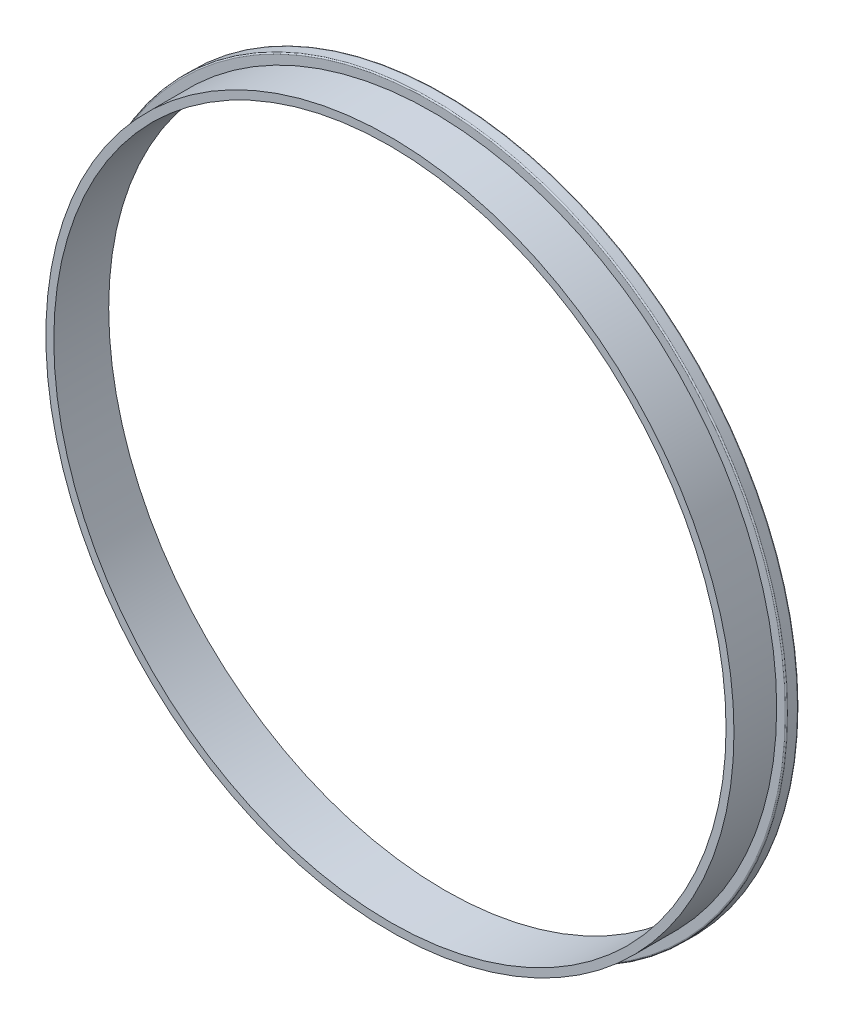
from build123d import *

# Parameters (mm, degrees)
SKETCH_1_R          = 58
SKETCH_1_R_2        = 55.1
EXTRUDE_1_DEPTH     = 9
SKETCH_2_OUTSIDE_W  = 150.86
SKETCH_2_OUTSIDE_H  = 150.86
SKETCH_2_OUTSIDE_R  = 56.4
CUT_EXTRUDE_1_DEPTH = 7
FILLET_1_R          = 0.2


with BuildPart() as part:
    # Sketch 1 → Extrude 1 (new body)
    with BuildSketch(Plane.XY):
        Circle(SKETCH_1_R)
        Circle(SKETCH_1_R_2, mode=Mode.SUBTRACT)
    extrude(amount=EXTRUDE_1_DEPTH)

    # Sketch 2 outside → Cut-Extrude 1 (cut)
    with BuildSketch(Plane.XY.offset(9)):
        Rectangle(SKETCH_2_OUTSIDE_W, SKETCH_2_OUTSIDE_H)
        Circle(SKETCH_2_OUTSIDE_R, mode=Mode.SUBTRACT)
    extrude(amount=-CUT_EXTRUDE_1_DEPTH, mode=Mode.SUBTRACT)

    # Fillet 1
    fillet_1_edges = [part.edges().sort_by_distance(p)[0] for p in [
        (-58, 0, 2),
        (-58, 0, 0),
    ]]
    fillet(fillet_1_edges, radius=FILLET_1_R)


solid = part.part
